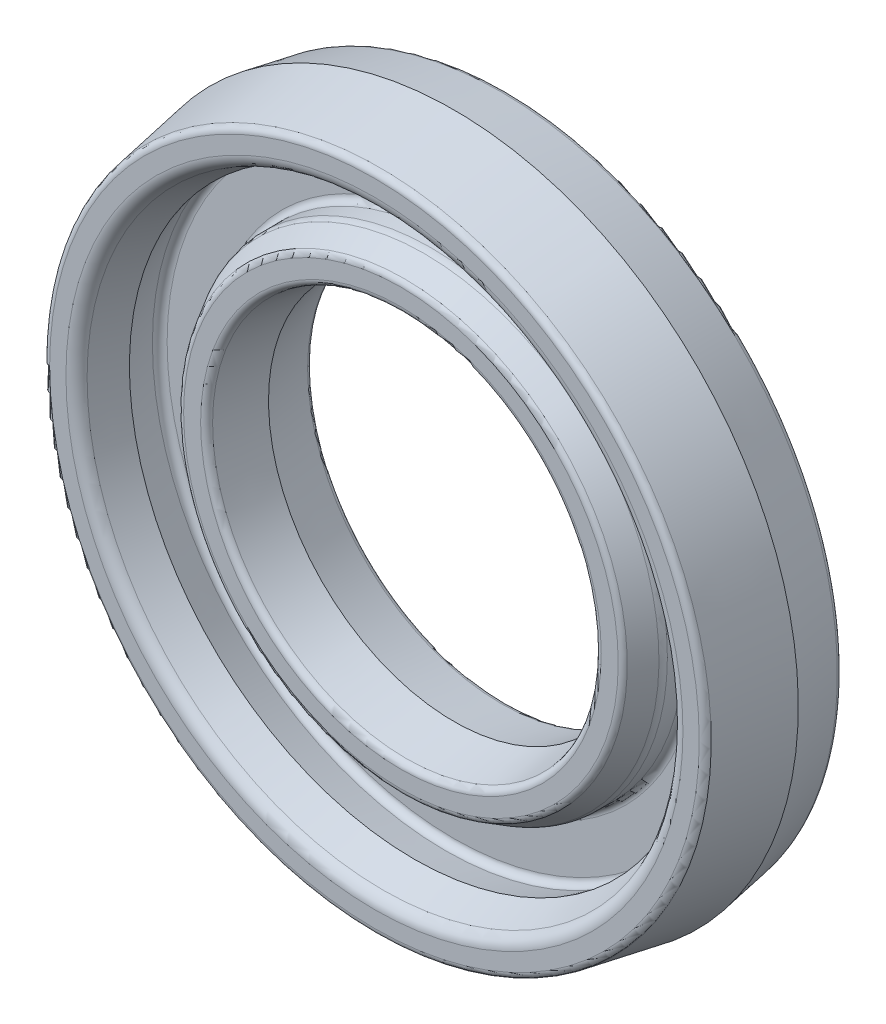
ISO-10303-21;
HEADER;
FILE_DESCRIPTION(('STEP AP214'),'2;1');
FILE_NAME('part.step','',(''),(''),'','','');
FILE_SCHEMA(('AUTOMOTIVE_DESIGN { 1 0 10303 214 1 1 1 1 }'));
ENDSEC;
DATA;
#1=APPLICATION_CONTEXT('core data for automotive mechanical design processes');
#2=APPLICATION_PROTOCOL_DEFINITION('international standard','automotive_design',2000,#1);
#3=PRODUCT_CONTEXT('',#1,'mechanical');
#4=PRODUCT('Part','Part','',(#3));
#5=PRODUCT_RELATED_PRODUCT_CATEGORY('part','',(#4));
#6=PRODUCT_DEFINITION_FORMATION('','',#4);
#7=PRODUCT_DEFINITION_CONTEXT('part definition',#1,'design');
#8=PRODUCT_DEFINITION('design','',#6,#7);
#9=PRODUCT_DEFINITION_SHAPE('','',#8);
#10=(LENGTH_UNIT() NAMED_UNIT(*) SI_UNIT(.MILLI.,.METRE.));
#11=(NAMED_UNIT(*) PLANE_ANGLE_UNIT() SI_UNIT($,.RADIAN.));
#12=(NAMED_UNIT(*) SI_UNIT($,.STERADIAN.) SOLID_ANGLE_UNIT());
#13=UNCERTAINTY_MEASURE_WITH_UNIT(LENGTH_MEASURE(1.E-05),#10,'distance_accuracy_value','');
#14=(GEOMETRIC_REPRESENTATION_CONTEXT(3) GLOBAL_UNCERTAINTY_ASSIGNED_CONTEXT((#13)) GLOBAL_UNIT_ASSIGNED_CONTEXT((#10,
#11,#12)) REPRESENTATION_CONTEXT('',''));
#15=CARTESIAN_POINT('',(0.,0.,0.));
#16=DIRECTION('',(0.,0.,1.));
#17=DIRECTION('',(1.,0.,0.));
#18=AXIS2_PLACEMENT_3D('',#15,#16,#17);
#19=CARTESIAN_POINT('',(23.8174584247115,23.8174584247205,4.));
#20=DIRECTION('',(0.,0.,1.));
#21=DIRECTION('',(0.,-1.,0.));
#22=AXIS2_PLACEMENT_3D('',#19,#20,#21);
#23=PLANE('',#22);
#24=CARTESIAN_POINT('',(0.,0.,4.));
#25=DIRECTION('',(0.,0.,1.));
#26=DIRECTION('',(1.,1.90675067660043E-13,0.));
#27=AXIS2_PLACEMENT_3D('',#24,#25,#26);
#28=CIRCLE('',#27,18.34999995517);
#29=CARTESIAN_POINT('',(-3.49753933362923E-12,18.349999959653,4.));
#30=VERTEX_POINT('',#29);
#31=CARTESIAN_POINT('',(18.349999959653,3.49871193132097E-12,4.));
#32=VERTEX_POINT('',#31);
#33=EDGE_CURVE('E188',#30,#32,#28,.F.);
#34=ORIENTED_EDGE('',*,*,#33,.T.);
#35=CARTESIAN_POINT('',(0.,0.,4.));
#36=DIRECTION('',(0.,0.,1.));
#37=DIRECTION('',(1.907363E-13,-1.,0.));
#38=AXIS2_PLACEMENT_3D('',#35,#36,#37);
#39=CIRCLE('',#38,18.34999995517);
#40=CARTESIAN_POINT('',(3.49888766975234E-12,-18.349999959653,4.));
#41=VERTEX_POINT('',#40);
#42=EDGE_CURVE('E174',#32,#41,#39,.F.);
#43=ORIENTED_EDGE('',*,*,#42,.T.);
#44=CARTESIAN_POINT('',(0.,0.,4.));
#45=DIRECTION('',(0.,0.,1.));
#46=DIRECTION('',(-1.,-1.90552602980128E-13,0.));
#47=AXIS2_PLACEMENT_3D('',#44,#45,#46);
#48=CIRCLE('',#47,18.34999995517);
#49=CARTESIAN_POINT('',(-18.349999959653,-3.49816451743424E-12,4.));
#50=VERTEX_POINT('',#49);
#51=EDGE_CURVE('E180',#41,#50,#48,.F.);
#52=ORIENTED_EDGE('',*,*,#51,.T.);
#53=CARTESIAN_POINT('',(0.,0.,4.));
#54=DIRECTION('',(0.,0.,1.));
#55=DIRECTION('',(-1.90613835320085E-13,1.,0.));
#56=AXIS2_PLACEMENT_3D('',#53,#54,#55);
#57=CIRCLE('',#56,18.34999995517);
#58=EDGE_CURVE('E185',#50,#30,#57,.F.);
#59=ORIENTED_EDGE('',*,*,#58,.T.);
#60=EDGE_LOOP('',(#34,#43,#52,#59));
#61=FACE_BOUND('',#60,.T.);
#62=CARTESIAN_POINT('',(0.,0.,4.));
#63=DIRECTION('',(0.,0.,-1.));
#64=DIRECTION('',(-1.90613835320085E-13,1.,0.));
#65=AXIS2_PLACEMENT_3D('',#62,#63,#64);
#66=CIRCLE('',#65,21.65223493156);
#67=CARTESIAN_POINT('',(21.652234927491,-2.90554025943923E-11,4.));
#68=VERTEX_POINT('',#67);
#69=CARTESIAN_POINT('',(-4.12778607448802E-12,21.652234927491,4.));
#70=VERTEX_POINT('',#69);
#71=EDGE_CURVE('E141',#68,#70,#66,.F.);
#72=ORIENTED_EDGE('',*,*,#71,.T.);
#73=CARTESIAN_POINT('',(0.,0.,4.));
#74=DIRECTION('',(0.,0.,-1.));
#75=DIRECTION('',(-1.,-1.90552602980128E-13,0.));
#76=AXIS2_PLACEMENT_3D('',#73,#74,#75);
#77=CIRCLE('',#76,21.65223493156);
#78=CARTESIAN_POINT('',(-21.652234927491,-4.12714480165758E-12,4.));
#79=VERTEX_POINT('',#78);
#80=EDGE_CURVE('E132',#70,#79,#77,.F.);
#81=ORIENTED_EDGE('',*,*,#80,.T.);
#82=CARTESIAN_POINT('',(0.,0.,4.));
#83=DIRECTION('',(0.,0.,-1.));
#84=DIRECTION('',(1.90491370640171E-13,-1.,0.));
#85=AXIS2_PLACEMENT_3D('',#82,#83,#84);
#86=CIRCLE('',#85,21.65223493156);
#87=CARTESIAN_POINT('',(4.12937705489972E-12,-21.652234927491,4.));
#88=VERTEX_POINT('',#87);
#89=EDGE_CURVE('E125',#79,#88,#86,.F.);
#90=ORIENTED_EDGE('',*,*,#89,.T.);
#91=CARTESIAN_POINT('',(0.,0.,4.));
#92=DIRECTION('',(0.,0.,-1.));
#93=DIRECTION('',(1.,1.90675067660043E-13,0.));
#94=AXIS2_PLACEMENT_3D('',#91,#92,#93);
#95=CIRCLE('',#94,21.65223493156);
#96=EDGE_CURVE('E128',#88,#68,#95,.F.);
#97=ORIENTED_EDGE('',*,*,#96,.T.);
#98=EDGE_LOOP('',(#72,#81,#90,#97));
#99=FACE_BOUND('',#98,.T.);
#100=ADVANCED_FACE('F16',(#61,#99),#23,.T.);
#101=CARTESIAN_POINT('',(0.,0.,4.5));
#102=DIRECTION('',(0.,0.,1.));
#103=DIRECTION('',(1.907363E-13,-1.,0.));
#104=AXIS2_PLACEMENT_3D('',#101,#102,#103);
#105=TOROIDAL_SURFACE('',#104,18.35,0.5);
#106=CARTESIAN_POINT('',(0.,0.,4.5));
#107=DIRECTION('',(0.,0.,-1.));
#108=DIRECTION('',(0.,1.,0.));
#109=AXIS2_PLACEMENT_3D('',#106,#107,#108);
#110=CIRCLE('',#109,17.85);
#111=CARTESIAN_POINT('',(0.,17.85,4.5));
#112=VERTEX_POINT('',#111);
#113=EDGE_CURVE('E172',#112,#112,#110,.F.);
#114=ORIENTED_EDGE('',*,*,#113,.F.);
#115=EDGE_LOOP('',(#114));
#116=FACE_BOUND('',#115,.T.);
#117=ORIENTED_EDGE('',*,*,#42,.F.);
#118=ORIENTED_EDGE('',*,*,#33,.F.);
#119=ORIENTED_EDGE('',*,*,#58,.F.);
#120=ORIENTED_EDGE('',*,*,#51,.F.);
#121=EDGE_LOOP('',(#117,#118,#119,#120));
#122=FACE_BOUND('',#121,.T.);
#123=ADVANCED_FACE('F161',(#116,#122),#105,.F.);
#124=CARTESIAN_POINT('',(0.,0.,4.5));
#125=DIRECTION('',(0.,0.,1.));
#126=DIRECTION('',(1.907363E-13,-1.,0.));
#127=AXIS2_PLACEMENT_3D('',#124,#125,#126);
#128=TOROIDAL_SURFACE('',#127,21.65223489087,0.5);
#129=ORIENTED_EDGE('',*,*,#96,.F.);
#130=ORIENTED_EDGE('',*,*,#89,.F.);
#131=ORIENTED_EDGE('',*,*,#80,.F.);
#132=ORIENTED_EDGE('',*,*,#71,.F.);
#133=EDGE_LOOP('',(#129,#130,#131,#132));
#134=FACE_BOUND('',#133,.T.);
#135=CARTESIAN_POINT('',(0.,0.,4.62940950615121));
#136=DIRECTION('',(0.,0.,-1.));
#137=DIRECTION('',(1.90736299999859E-13,-1.,0.));
#138=AXIS2_PLACEMENT_3D('',#135,#136,#137);
#139=CIRCLE('',#138,22.1351977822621);
#140=CARTESIAN_POINT('',(4.22198572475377E-12,-22.1351977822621,4.62940950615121));
#141=VERTEX_POINT('',#140);
#142=EDGE_CURVE('E170',#141,#141,#139,.F.);
#143=ORIENTED_EDGE('',*,*,#142,.T.);
#144=EDGE_LOOP('',(#143));
#145=FACE_BOUND('',#144,.T.);
#146=ADVANCED_FACE('F139',(#134,#145),#128,.F.);
#147=CARTESIAN_POINT('',(0.,0.,-0.5));
#148=DIRECTION('',(0.,0.,-1.));
#149=DIRECTION('',(0.,1.,0.));
#150=AXIS2_PLACEMENT_3D('',#147,#148,#149);
#151=CYLINDRICAL_SURFACE('',#150,17.85);
#152=ORIENTED_EDGE('',*,*,#113,.T.);
#153=EDGE_LOOP('',(#152));
#154=FACE_BOUND('',#153,.T.);
#155=CARTESIAN_POINT('',(0.,0.,5.732050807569));
#156=DIRECTION('',(0.,0.,1.));
#157=DIRECTION('',(1.907363E-13,-1.,0.));
#158=AXIS2_PLACEMENT_3D('',#155,#156,#157);
#159=CIRCLE('',#158,17.85);
#160=CARTESIAN_POINT('',(3.404642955E-12,-17.85,5.732050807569));
#161=VERTEX_POINT('',#160);
#162=EDGE_CURVE('E179',#161,#161,#159,.T.);
#163=ORIENTED_EDGE('',*,*,#162,.F.);
#164=EDGE_LOOP('',(#163));
#165=FACE_BOUND('',#164,.T.);
#166=ADVANCED_FACE('F160',(#154,#165),#151,.T.);
#167=CARTESIAN_POINT('',(0.,0.,4.62940950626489));
#168=DIRECTION('',(0.,0.,-1.));
#169=DIRECTION('',(0.,1.,0.));
#170=AXIS2_PLACEMENT_3D('',#167,#168,#169);
#171=CONICAL_SURFACE('',#170,22.1351977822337,0.261799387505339);
#172=ORIENTED_EDGE('',*,*,#142,.F.);
#173=EDGE_LOOP('',(#172));
#174=FACE_BOUND('',#173,.T.);
#175=CARTESIAN_POINT('',(0.,0.,7.00000000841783));
#176=DIRECTION('',(0.,0.,1.));
#177=DIRECTION('',(1.90736299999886E-13,-1.,0.));
#178=AXIS2_PLACEMENT_3D('',#175,#176,#177);
#179=CIRCLE('',#178,21.4999999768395);
#180=CARTESIAN_POINT('',(4.10083044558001E-12,-21.4999999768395,7.00000000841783));
#181=VERTEX_POINT('',#180);
#182=EDGE_CURVE('E991',#181,#181,#179,.T.);
#183=ORIENTED_EDGE('',*,*,#182,.T.);
#184=EDGE_LOOP('',(#183));
#185=FACE_BOUND('',#184,.T.);
#186=ADVANCED_FACE('F262',(#174,#185),#171,.F.);
#187=CARTESIAN_POINT('',(0.,0.,5.732050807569));
#188=DIRECTION('',(0.,0.,1.));
#189=DIRECTION('',(1.907363E-13,-1.,0.));
#190=AXIS2_PLACEMENT_3D('',#187,#188,#189);
#191=TOROIDAL_SURFACE('',#190,16.85,1.);
#192=ORIENTED_EDGE('',*,*,#162,.T.);
#193=EDGE_LOOP('',(#192));
#194=FACE_BOUND('',#193,.T.);
#195=CARTESIAN_POINT('',(0.,0.,6.23205078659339));
#196=DIRECTION('',(0.,0.,-1.));
#197=DIRECTION('',(-1.90736299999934E-13,1.,0.));
#198=AXIS2_PLACEMENT_3D('',#195,#196,#197);
#199=CIRCLE('',#198,17.7160253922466);
#200=CARTESIAN_POINT('',(-3.379089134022E-12,17.7160253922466,6.23205078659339));
#201=VERTEX_POINT('',#200);
#202=EDGE_CURVE('E254',#201,#201,#199,.F.);
#203=ORIENTED_EDGE('',*,*,#202,.F.);
#204=EDGE_LOOP('',(#203));
#205=FACE_BOUND('',#204,.T.);
#206=ADVANCED_FACE('F259',(#194,#205),#191,.T.);
#207=CARTESIAN_POINT('',(0.,0.,9.34201997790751));
#208=DIRECTION('',(0.,0.,1.));
#209=DIRECTION('',(0.,-1.,0.));
#210=AXIS2_PLACEMENT_3D('',#207,#208,#209);
#211=CONICAL_SURFACE('',#210,22.3524255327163,0.349065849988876);
#212=ORIENTED_EDGE('',*,*,#182,.F.);
#213=EDGE_LOOP('',(#212));
#214=FACE_BOUND('',#213,.T.);
#215=CARTESIAN_POINT('',(0.,0.,9.34201996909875));
#216=DIRECTION('',(0.,0.,1.));
#217=DIRECTION('',(1.907363E-13,-1.,0.));
#218=AXIS2_PLACEMENT_3D('',#215,#216,#217);
#219=CIRCLE('',#218,22.3524255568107);
#220=CARTESIAN_POINT('',(4.26341894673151E-12,-22.3524255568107,9.34201996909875));
#221=VERTEX_POINT('',#220);
#222=EDGE_CURVE('E251',#221,#221,#219,.F.);
#223=ORIENTED_EDGE('',*,*,#222,.F.);
#224=EDGE_LOOP('',(#223));
#225=FACE_BOUND('',#224,.T.);
#226=ADVANCED_FACE('F261',(#214,#225),#211,.F.);
#227=CARTESIAN_POINT('',(0.,0.,6.23205078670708));
#228=DIRECTION('',(0.,0.,-1.));
#229=DIRECTION('',(0.,1.,0.));
#230=AXIS2_PLACEMENT_3D('',#227,#228,#229);
#231=CONICAL_SURFACE('',#230,17.7160253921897,0.52359877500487);
#232=ORIENTED_EDGE('',*,*,#202,.T.);
#233=EDGE_LOOP('',(#232));
#234=FACE_BOUND('',#233,.T.);
#235=CARTESIAN_POINT('',(0.,0.,7.749999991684));
#236=DIRECTION('',(0.,0.,1.));
#237=DIRECTION('',(1.907363E-13,-1.,0.));
#238=AXIS2_PLACEMENT_3D('',#235,#236,#237);
#239=CIRCLE('',#238,16.8396370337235);
#240=CARTESIAN_POINT('',(3.21193006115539E-12,-16.8396370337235,7.749999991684));
#241=VERTEX_POINT('',#240);
#242=EDGE_CURVE('E242',#241,#241,#239,.T.);
#243=ORIENTED_EDGE('',*,*,#242,.F.);
#244=EDGE_LOOP('',(#243));
#245=FACE_BOUND('',#244,.T.);
#246=ADVANCED_FACE('F221',(#234,#245),#231,.T.);
#247=CARTESIAN_POINT('',(0.,0.,9.));
#248=DIRECTION('',(0.,0.,1.));
#249=DIRECTION('',(1.907363E-13,-1.,0.));
#250=AXIS2_PLACEMENT_3D('',#247,#248,#249);
#251=TOROIDAL_SURFACE('',#250,23.29211824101,1.);
#252=CARTESIAN_POINT('',(0.,0.,9.99999999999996));
#253=DIRECTION('',(0.,0.,1.));
#254=DIRECTION('',(-1.,-1.90552602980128E-13,0.));
#255=AXIS2_PLACEMENT_3D('',#252,#253,#254);
#256=CIRCLE('',#255,23.292117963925);
#257=CARTESIAN_POINT('',(-23.292117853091,-4.43958230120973E-12,9.99999999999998));
#258=VERTEX_POINT('',#257);
#259=CARTESIAN_POINT('',(4.4419482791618E-12,-23.292117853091,9.99999999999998));
#260=VERTEX_POINT('',#259);
#261=EDGE_CURVE('E250',#258,#260,#256,.T.);
#262=ORIENTED_EDGE('',*,*,#261,.T.);
#263=CARTESIAN_POINT('',(0.,0.,9.99999999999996));
#264=DIRECTION('',(0.,0.,1.));
#265=DIRECTION('',(1.907363E-13,-1.,0.));
#266=AXIS2_PLACEMENT_3D('',#263,#264,#265);
#267=CIRCLE('',#266,23.292117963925);
#268=CARTESIAN_POINT('',(23.292117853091,4.4417854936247E-12,9.99999999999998));
#269=VERTEX_POINT('',#268);
#270=EDGE_CURVE('E562',#260,#269,#267,.T.);
#271=ORIENTED_EDGE('',*,*,#270,.T.);
#272=CARTESIAN_POINT('',(0.,0.,9.99999999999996));
#273=DIRECTION('',(0.,0.,1.));
#274=DIRECTION('',(1.,1.90675067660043E-13,0.));
#275=AXIS2_PLACEMENT_3D('',#272,#273,#274);
#276=CIRCLE('',#275,23.292117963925);
#277=CARTESIAN_POINT('',(-4.44023680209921E-12,23.292117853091,9.99999999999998));
#278=VERTEX_POINT('',#277);
#279=EDGE_CURVE('E572',#269,#278,#276,.T.);
#280=ORIENTED_EDGE('',*,*,#279,.T.);
#281=CARTESIAN_POINT('',(0.,0.,9.99999999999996));
#282=DIRECTION('',(0.,0.,1.));
#283=DIRECTION('',(-1.90613835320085E-13,1.,0.));
#284=AXIS2_PLACEMENT_3D('',#281,#282,#283);
#285=CIRCLE('',#284,23.292117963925);
#286=EDGE_CURVE('E237',#278,#258,#285,.T.);
#287=ORIENTED_EDGE('',*,*,#286,.T.);
#288=EDGE_LOOP('',(#262,#271,#280,#287));
#289=FACE_BOUND('',#288,.T.);
#290=ORIENTED_EDGE('',*,*,#222,.T.);
#291=EDGE_LOOP('',(#290));
#292=FACE_BOUND('',#291,.T.);
#293=ADVANCED_FACE('F209',(#289,#292),#251,.T.);
#294=CARTESIAN_POINT('',(0.,0.,7.5));
#295=DIRECTION('',(0.,0.,1.));
#296=DIRECTION('',(1.907363E-13,-1.,0.));
#297=AXIS2_PLACEMENT_3D('',#294,#295,#296);
#298=TOROIDAL_SURFACE('',#297,16.40662432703,0.5);
#299=ORIENTED_EDGE('',*,*,#242,.T.);
#300=EDGE_LOOP('',(#299));
#301=FACE_BOUND('',#300,.T.);
#302=CARTESIAN_POINT('',(0.,0.,8.));
#303=DIRECTION('',(0.,0.,-1.));
#304=DIRECTION('',(1.90491370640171E-13,-1.,0.));
#305=AXIS2_PLACEMENT_3D('',#302,#303,#304);
#306=CIRCLE('',#305,16.4066243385);
#307=CARTESIAN_POINT('',(-16.406624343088,-3.12729123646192E-12,8.));
#308=VERTEX_POINT('',#307);
#309=CARTESIAN_POINT('',(3.12799197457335E-12,-16.406624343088,8.));
#310=VERTEX_POINT('',#309);
#311=EDGE_CURVE('E601',#308,#310,#306,.F.);
#312=ORIENTED_EDGE('',*,*,#311,.F.);
#313=CARTESIAN_POINT('',(0.,0.,8.));
#314=DIRECTION('',(0.,0.,-1.));
#315=DIRECTION('',(-1.,-1.90552602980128E-13,0.));
#316=AXIS2_PLACEMENT_3D('',#313,#314,#315);
#317=CIRCLE('',#316,16.4066243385);
#318=CARTESIAN_POINT('',(-5.19018300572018E-12,16.406624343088,8.));
#319=VERTEX_POINT('',#318);
#320=EDGE_CURVE('E603',#319,#308,#317,.F.);
#321=ORIENTED_EDGE('',*,*,#320,.F.);
#322=CARTESIAN_POINT('',(0.,0.,8.));
#323=DIRECTION('',(0.,0.,-1.));
#324=DIRECTION('',(-8.19444156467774E-13,1.,0.));
#325=AXIS2_PLACEMENT_3D('',#322,#323,#324);
#326=CIRCLE('',#325,16.4066243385);
#327=CARTESIAN_POINT('',(16.406624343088,3.12788901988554E-12,8.));
#328=VERTEX_POINT('',#327);
#329=EDGE_CURVE('E606',#328,#319,#326,.F.);
#330=ORIENTED_EDGE('',*,*,#329,.F.);
#331=CARTESIAN_POINT('',(0.,0.,8.));
#332=DIRECTION('',(0.,0.,-1.));
#333=DIRECTION('',(1.,1.90675067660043E-13,0.));
#334=AXIS2_PLACEMENT_3D('',#331,#332,#333);
#335=CIRCLE('',#334,16.4066243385);
#336=EDGE_CURVE('E435',#310,#328,#335,.F.);
#337=ORIENTED_EDGE('',*,*,#336,.F.);
#338=EDGE_LOOP('',(#312,#321,#330,#337));
#339=FACE_BOUND('',#338,.T.);
#340=ADVANCED_FACE('F220',(#301,#339),#298,.T.);
#341=CARTESIAN_POINT('',(-26.9747371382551,26.9747371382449,10.));
#342=DIRECTION('',(0.,0.,-1.));
#343=DIRECTION('',(0.,1.,0.));
#344=AXIS2_PLACEMENT_3D('',#341,#342,#343);
#345=PLANE('',#344);
#346=ORIENTED_EDGE('',*,*,#279,.F.);
#347=ORIENTED_EDGE('',*,*,#270,.F.);
#348=ORIENTED_EDGE('',*,*,#261,.F.);
#349=ORIENTED_EDGE('',*,*,#286,.F.);
#350=EDGE_LOOP('',(#346,#347,#348,#349));
#351=FACE_BOUND('',#350,.T.);
#352=CARTESIAN_POINT('',(0.,0.,10.));
#353=DIRECTION('',(0.,0.,-1.));
#354=DIRECTION('',(1.,1.90675067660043E-13,0.));
#355=AXIS2_PLACEMENT_3D('',#352,#353,#354);
#356=CIRCLE('',#355,24.5224883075);
#357=CARTESIAN_POINT('',(24.522488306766,4.67555737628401E-12,10.));
#358=VERTEX_POINT('',#357);
#359=CARTESIAN_POINT('',(4.67573522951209E-12,-24.522488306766,10.));
#360=VERTEX_POINT('',#359);
#361=EDGE_CURVE('E530',#358,#360,#356,.T.);
#362=ORIENTED_EDGE('',*,*,#361,.F.);
#363=CARTESIAN_POINT('',(0.,0.,10.));
#364=DIRECTION('',(0.,0.,-1.));
#365=DIRECTION('',(-1.90613835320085E-13,1.,0.));
#366=AXIS2_PLACEMENT_3D('',#363,#364,#365);
#367=CIRCLE('',#366,24.5224883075);
#368=CARTESIAN_POINT('',(-4.67393334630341E-12,24.522488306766,10.));
#369=VERTEX_POINT('',#368);
#370=EDGE_CURVE('E520',#369,#358,#367,.T.);
#371=ORIENTED_EDGE('',*,*,#370,.F.);
#372=CARTESIAN_POINT('',(0.,0.,10.));
#373=DIRECTION('',(0.,0.,-1.));
#374=DIRECTION('',(-1.,-1.90552602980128E-13,0.));
#375=AXIS2_PLACEMENT_3D('',#372,#373,#374);
#376=CIRCLE('',#375,24.5224883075);
#377=CARTESIAN_POINT('',(-24.522488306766,-4.67332404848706E-12,10.));
#378=VERTEX_POINT('',#377);
#379=EDGE_CURVE('E509',#378,#369,#376,.T.);
#380=ORIENTED_EDGE('',*,*,#379,.F.);
#381=CARTESIAN_POINT('',(0.,0.,10.));
#382=DIRECTION('',(0.,0.,-1.));
#383=DIRECTION('',(1.90491370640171E-13,-1.,0.));
#384=AXIS2_PLACEMENT_3D('',#381,#382,#383);
#385=CIRCLE('',#384,24.5224883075);
#386=EDGE_CURVE('E540',#360,#378,#385,.T.);
#387=ORIENTED_EDGE('',*,*,#386,.F.);
#388=EDGE_LOOP('',(#362,#371,#380,#387));
#389=FACE_BOUND('',#388,.T.);
#390=ADVANCED_FACE('F448',(#351,#389),#345,.F.);
#391=CARTESIAN_POINT('',(18.0472867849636,18.0472867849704,8.));
#392=DIRECTION('',(0.,0.,1.));
#393=DIRECTION('',(0.,-1.,0.));
#394=AXIS2_PLACEMENT_3D('',#391,#392,#393);
#395=PLANE('',#394);
#396=CARTESIAN_POINT('',(0.,0.,7.99999999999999));
#397=DIRECTION('',(0.,0.,1.));
#398=DIRECTION('',(-1.90613835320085E-13,1.,0.));
#399=AXIS2_PLACEMENT_3D('',#396,#397,#398);
#400=CIRCLE('',#399,15.12485764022);
#401=CARTESIAN_POINT('',(-2.88304844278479E-12,15.12485765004,8.));
#402=VERTEX_POINT('',#401);
#403=CARTESIAN_POINT('',(-15.12485765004,-2.8821183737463E-12,8.));
#404=VERTEX_POINT('',#403);
#405=EDGE_CURVE('E686',#402,#404,#400,.T.);
#406=ORIENTED_EDGE('',*,*,#405,.F.);
#407=CARTESIAN_POINT('',(0.,0.,7.99999999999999));
#408=DIRECTION('',(0.,0.,1.));
#409=DIRECTION('',(1.,1.90675067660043E-13,0.));
#410=AXIS2_PLACEMENT_3D('',#407,#408,#409);
#411=CIRCLE('',#410,15.12485764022);
#412=CARTESIAN_POINT('',(15.12485765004,2.88476643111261E-12,8.));
#413=VERTEX_POINT('',#412);
#414=EDGE_CURVE('E393',#413,#402,#411,.T.);
#415=ORIENTED_EDGE('',*,*,#414,.F.);
#416=CARTESIAN_POINT('',(0.,0.,7.99999999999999));
#417=DIRECTION('',(0.,0.,1.));
#418=DIRECTION('',(1.907363E-13,-1.,0.));
#419=AXIS2_PLACEMENT_3D('',#416,#417,#418);
#420=CIRCLE('',#419,15.12485764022);
#421=CARTESIAN_POINT('',(2.88415979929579E-12,-15.12485765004,8.));
#422=VERTEX_POINT('',#421);
#423=EDGE_CURVE('E427',#422,#413,#420,.T.);
#424=ORIENTED_EDGE('',*,*,#423,.F.);
#425=CARTESIAN_POINT('',(0.,0.,7.99999999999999));
#426=DIRECTION('',(0.,0.,1.));
#427=DIRECTION('',(-1.,-1.90552602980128E-13,0.));
#428=AXIS2_PLACEMENT_3D('',#425,#426,#427);
#429=CIRCLE('',#428,15.12485764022);
#430=EDGE_CURVE('E696',#404,#422,#429,.T.);
#431=ORIENTED_EDGE('',*,*,#430,.F.);
#432=EDGE_LOOP('',(#406,#415,#424,#431));
#433=FACE_BOUND('',#432,.T.);
#434=ORIENTED_EDGE('',*,*,#320,.T.);
#435=ORIENTED_EDGE('',*,*,#311,.T.);
#436=ORIENTED_EDGE('',*,*,#336,.T.);
#437=ORIENTED_EDGE('',*,*,#329,.T.);
#438=EDGE_LOOP('',(#434,#435,#436,#437));
#439=FACE_BOUND('',#438,.T.);
#440=ADVANCED_FACE('F440',(#433,#439),#395,.T.);
#441=CARTESIAN_POINT('',(0.,0.,9.5));
#442=DIRECTION('',(0.,0.,1.));
#443=DIRECTION('',(1.907363E-13,-1.,0.));
#444=AXIS2_PLACEMENT_3D('',#441,#442,#443);
#445=TOROIDAL_SURFACE('',#444,24.52248830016,0.5);
#446=ORIENTED_EDGE('',*,*,#361,.T.);
#447=ORIENTED_EDGE('',*,*,#386,.T.);
#448=ORIENTED_EDGE('',*,*,#379,.T.);
#449=ORIENTED_EDGE('',*,*,#370,.T.);
#450=EDGE_LOOP('',(#446,#447,#448,#449));
#451=FACE_BOUND('',#450,.T.);
#452=CARTESIAN_POINT('',(0.,0.,9.58682408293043));
#453=DIRECTION('',(0.,0.,-1.));
#454=DIRECTION('',(1.90736300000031E-13,-1.,0.));
#455=AXIS2_PLACEMENT_3D('',#452,#453,#454);
#456=CIRCLE('',#455,25.0148921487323);
#457=CARTESIAN_POINT('',(4.77124797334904E-12,-25.0148921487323,9.58682408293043));
#458=VERTEX_POINT('',#457);
#459=EDGE_CURVE('E425',#458,#458,#456,.T.);
#460=ORIENTED_EDGE('',*,*,#459,.F.);
#461=EDGE_LOOP('',(#460));
#462=FACE_BOUND('',#461,.T.);
#463=ADVANCED_FACE('F412',(#451,#462),#445,.T.);
#464=CARTESIAN_POINT('',(0.,0.,7.5));
#465=DIRECTION('',(0.,0.,1.));
#466=DIRECTION('',(1.907363E-13,-1.,0.));
#467=AXIS2_PLACEMENT_3D('',#464,#465,#466);
#468=TOROIDAL_SURFACE('',#467,15.12485773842,0.5);
#469=ORIENTED_EDGE('',*,*,#414,.T.);
#470=ORIENTED_EDGE('',*,*,#405,.T.);
#471=ORIENTED_EDGE('',*,*,#430,.T.);
#472=ORIENTED_EDGE('',*,*,#423,.T.);
#473=EDGE_LOOP('',(#469,#470,#471,#472));
#474=FACE_BOUND('',#473,.T.);
#475=CARTESIAN_POINT('',(0.,0.,7.58682407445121));
#476=DIRECTION('',(0.,0.,1.));
#477=DIRECTION('',(-2.47052929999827E-12,1.,0.));
#478=AXIS2_PLACEMENT_3D('',#475,#476,#477);
#479=CIRCLE('',#478,14.6324538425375);
#480=CARTESIAN_POINT('',(-3.61499059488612E-11,14.6324538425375,7.58682407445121));
#481=VERTEX_POINT('',#480);
#482=EDGE_CURVE('E423',#481,#481,#479,.F.);
#483=ORIENTED_EDGE('',*,*,#482,.T.);
#484=EDGE_LOOP('',(#483));
#485=FACE_BOUND('',#484,.T.);
#486=ADVANCED_FACE('F400',(#474,#485),#468,.T.);
#487=CARTESIAN_POINT('',(0.,0.,3.99999999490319));
#488=DIRECTION('',(0.,0.,-1.));
#489=DIRECTION('',(0.,1.,0.));
#490=AXIS2_PLACEMENT_3D('',#487,#488,#489);
#491=CONICAL_SURFACE('',#490,25.9999999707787,0.174532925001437);
#492=ORIENTED_EDGE('',*,*,#459,.T.);
#493=EDGE_LOOP('',(#492));
#494=FACE_BOUND('',#493,.T.);
#495=CARTESIAN_POINT('',(0.,0.,4.00000000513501));
#496=DIRECTION('',(0.,0.,1.));
#497=DIRECTION('',(1.90736299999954E-13,-1.,0.));
#498=AXIS2_PLACEMENT_3D('',#495,#496,#497);
#499=CIRCLE('',#498,25.9999999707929);
#500=CARTESIAN_POINT('',(4.95914379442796E-12,-25.9999999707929,4.00000000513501));
#501=VERTEX_POINT('',#500);
#502=EDGE_CURVE('E700',#501,#501,#499,.F.);
#503=ORIENTED_EDGE('',*,*,#502,.F.);
#504=EDGE_LOOP('',(#503));
#505=FACE_BOUND('',#504,.T.);
#506=ADVANCED_FACE('F411',(#494,#505),#491,.T.);
#507=CARTESIAN_POINT('',(0.,0.,7.58682407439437));
#508=DIRECTION('',(0.,0.,1.));
#509=DIRECTION('',(0.,-1.,0.));
#510=AXIS2_PLACEMENT_3D('',#507,#508,#509);
#511=CONICAL_SURFACE('',#510,14.6324538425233,0.174532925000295);
#512=CARTESIAN_POINT('',(0.,0.,3.99999999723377));
#513=DIRECTION('',(0.,0.,-1.));
#514=DIRECTION('',(1.07853169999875E-12,1.,0.));
#515=AXIS2_PLACEMENT_3D('',#512,#513,#514);
#516=CIRCLE('',#515,13.9999999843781);
#517=CARTESIAN_POINT('',(1.50994437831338E-11,13.9999999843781,3.99999999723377));
#518=VERTEX_POINT('',#517);
#519=EDGE_CURVE('E702',#518,#518,#516,.T.);
#520=ORIENTED_EDGE('',*,*,#519,.T.);
#521=EDGE_LOOP('',(#520));
#522=FACE_BOUND('',#521,.T.);
#523=ORIENTED_EDGE('',*,*,#482,.F.);
#524=EDGE_LOOP('',(#523));
#525=FACE_BOUND('',#524,.T.);
#526=ADVANCED_FACE('F933',(#522,#525),#511,.F.);
#527=CARTESIAN_POINT('',(0.,0.,4.00000000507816));
#528=DIRECTION('',(0.,0.,1.));
#529=DIRECTION('',(0.,-1.,0.));
#530=AXIS2_PLACEMENT_3D('',#527,#528,#529);
#531=CONICAL_SURFACE('',#530,25.9999999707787,0.174532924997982);
#532=ORIENTED_EDGE('',*,*,#502,.T.);
#533=EDGE_LOOP('',(#532));
#534=FACE_BOUND('',#533,.T.);
#535=CARTESIAN_POINT('',(0.,0.,0.413175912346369));
#536=DIRECTION('',(0.,0.,1.));
#537=DIRECTION('',(1.907363E-13,-1.,0.));
#538=AXIS2_PLACEMENT_3D('',#535,#536,#537);
#539=CIRCLE('',#538,25.3675461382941);
#540=CARTESIAN_POINT('',(4.83851189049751E-12,-25.3675461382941,0.413175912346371));
#541=VERTEX_POINT('',#540);
#542=EDGE_CURVE('E706',#541,#541,#539,.F.);
#543=ORIENTED_EDGE('',*,*,#542,.F.);
#544=EDGE_LOOP('',(#543));
#545=FACE_BOUND('',#544,.T.);
#546=ADVANCED_FACE('F942',(#534,#545),#531,.T.);
#547=CARTESIAN_POINT('',(0.,0.,0.413175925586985));
#548=DIRECTION('',(0.,0.,-1.));
#549=DIRECTION('',(0.,1.,0.));
#550=AXIS2_PLACEMENT_3D('',#547,#548,#549);
#551=CONICAL_SURFACE('',#550,14.6324538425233,0.174532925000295);
#552=CARTESIAN_POINT('',(0.,0.,0.413175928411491));
#553=DIRECTION('',(0.,0.,1.));
#554=DIRECTION('',(1.907363E-13,-1.,0.));
#555=AXIS2_PLACEMENT_3D('',#552,#553,#554);
#556=CIRCLE('',#555,14.6324538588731);
#557=CARTESIAN_POINT('',(2.79094010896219E-12,-14.6324538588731,0.413175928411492));
#558=VERTEX_POINT('',#557);
#559=EDGE_CURVE('E710',#558,#558,#556,.T.);
#560=ORIENTED_EDGE('',*,*,#559,.F.);
#561=EDGE_LOOP('',(#560));
#562=FACE_BOUND('',#561,.T.);
#563=ORIENTED_EDGE('',*,*,#519,.F.);
#564=EDGE_LOOP('',(#563));
#565=FACE_BOUND('',#564,.T.);
#566=ADVANCED_FACE('F354',(#562,#565),#551,.F.);
#567=CARTESIAN_POINT('',(0.,0.,0.5));
#568=DIRECTION('',(0.,0.,1.));
#569=DIRECTION('',(1.907363E-13,-1.,0.));
#570=AXIS2_PLACEMENT_3D('',#567,#568,#569);
#571=TOROIDAL_SURFACE('',#570,24.87514226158,0.5);
#572=ORIENTED_EDGE('',*,*,#542,.T.);
#573=EDGE_LOOP('',(#572));
#574=FACE_BOUND('',#573,.T.);
#575=CARTESIAN_POINT('',(0.,0.,0.));
#576=DIRECTION('',(0.,0.,1.));
#577=DIRECTION('',(-1.,-1.90552602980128E-13,0.));
#578=AXIS2_PLACEMENT_3D('',#575,#576,#577);
#579=CIRCLE('',#578,24.875142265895);
#580=CARTESIAN_POINT('',(4.74384915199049E-12,-24.875142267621,0.));
#581=VERTEX_POINT('',#580);
#582=CARTESIAN_POINT('',(-24.875142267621,-4.74154747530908E-12,0.));
#583=VERTEX_POINT('',#582);
#584=EDGE_CURVE('E380',#581,#583,#579,.F.);
#585=ORIENTED_EDGE('',*,*,#584,.F.);
#586=CARTESIAN_POINT('',(0.,0.,0.));
#587=DIRECTION('',(0.,0.,1.));
#588=DIRECTION('',(1.907363E-13,-1.,0.));
#589=AXIS2_PLACEMENT_3D('',#586,#587,#588);
#590=CIRCLE('',#589,24.875142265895);
#591=CARTESIAN_POINT('',(24.875142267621,4.74354451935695E-12,0.));
#592=VERTEX_POINT('',#591);
#593=EDGE_CURVE('E712',#592,#581,#590,.F.);
#594=ORIENTED_EDGE('',*,*,#593,.F.);
#595=CARTESIAN_POINT('',(0.,0.,0.));
#596=DIRECTION('',(0.,0.,1.));
#597=DIRECTION('',(1.,1.90675067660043E-13,0.));
#598=AXIS2_PLACEMENT_3D('',#595,#596,#597);
#599=CIRCLE('',#598,24.875142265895);
#600=CARTESIAN_POINT('',(-4.74202135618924E-12,24.875142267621,0.));
#601=VERTEX_POINT('',#600);
#602=EDGE_CURVE('E717',#601,#592,#599,.F.);
#603=ORIENTED_EDGE('',*,*,#602,.F.);
#604=CARTESIAN_POINT('',(0.,0.,0.));
#605=DIRECTION('',(0.,0.,1.));
#606=DIRECTION('',(-1.90613835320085E-13,1.,0.));
#607=AXIS2_PLACEMENT_3D('',#604,#605,#606);
#608=CIRCLE('',#607,24.875142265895);
#609=EDGE_CURVE('E715',#583,#601,#608,.F.);
#610=ORIENTED_EDGE('',*,*,#609,.F.);
#611=EDGE_LOOP('',(#585,#594,#603,#610));
#612=FACE_BOUND('',#611,.T.);
#613=ADVANCED_FACE('F280',(#574,#612),#571,.T.);
#614=CARTESIAN_POINT('',(0.,0.,0.5));
#615=DIRECTION('',(0.,0.,1.));
#616=DIRECTION('',(1.907363E-13,-1.,0.));
#617=AXIS2_PLACEMENT_3D('',#614,#615,#616);
#618=TOROIDAL_SURFACE('',#617,15.12485773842,0.5);
#619=ORIENTED_EDGE('',*,*,#559,.T.);
#620=EDGE_LOOP('',(#619));
#621=FACE_BOUND('',#620,.T.);
#622=CARTESIAN_POINT('',(0.,0.,0.));
#623=DIRECTION('',(0.,0.,-1.));
#624=DIRECTION('',(-1.,-1.90552602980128E-13,0.));
#625=AXIS2_PLACEMENT_3D('',#622,#623,#624);
#626=CIRCLE('',#625,15.124857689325);
#627=CARTESIAN_POINT('',(-2.88304844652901E-12,15.124857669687,0.));
#628=VERTEX_POINT('',#627);
#629=CARTESIAN_POINT('',(-15.124857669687,-2.88360412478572E-12,0.));
#630=VERTEX_POINT('',#629);
#631=EDGE_CURVE('E719',#628,#630,#626,.F.);
#632=ORIENTED_EDGE('',*,*,#631,.F.);
#633=CARTESIAN_POINT('',(0.,0.,0.));
#634=DIRECTION('',(0.,0.,-1.));
#635=DIRECTION('',(-1.90613835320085E-13,1.,0.));
#636=AXIS2_PLACEMENT_3D('',#633,#634,#635);
#637=CIRCLE('',#636,15.124857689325);
#638=CARTESIAN_POINT('',(15.124857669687,2.88466846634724E-12,0.));
#639=VERTEX_POINT('',#638);
#640=EDGE_CURVE('E718',#639,#628,#637,.F.);
#641=ORIENTED_EDGE('',*,*,#640,.F.);
#642=CARTESIAN_POINT('',(0.,0.,0.));
#643=DIRECTION('',(0.,0.,-1.));
#644=DIRECTION('',(1.,1.90675067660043E-13,0.));
#645=AXIS2_PLACEMENT_3D('',#642,#643,#644);
#646=CIRCLE('',#645,15.124857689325);
#647=CARTESIAN_POINT('',(2.88415980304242E-12,-15.124857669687,0.));
#648=VERTEX_POINT('',#647);
#649=EDGE_CURVE('E10',#648,#639,#646,.F.);
#650=ORIENTED_EDGE('',*,*,#649,.F.);
#651=CARTESIAN_POINT('',(0.,0.,0.));
#652=DIRECTION('',(0.,0.,-1.));
#653=DIRECTION('',(1.90491370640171E-13,-1.,0.));
#654=AXIS2_PLACEMENT_3D('',#651,#652,#653);
#655=CIRCLE('',#654,15.124857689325);
#656=EDGE_CURVE('E27',#630,#648,#655,.F.);
#657=ORIENTED_EDGE('',*,*,#656,.F.);
#658=EDGE_LOOP('',(#632,#641,#650,#657));
#659=FACE_BOUND('',#658,.T.);
#660=ADVANCED_FACE('F274',(#621,#659),#618,.T.);
#661=CARTESIAN_POINT('',(-27.3626564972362,27.3626564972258,0.));
#662=DIRECTION('',(0.,0.,-1.));
#663=DIRECTION('',(0.,1.,0.));
#664=AXIS2_PLACEMENT_3D('',#661,#662,#663);
#665=PLANE('',#664);
#666=ORIENTED_EDGE('',*,*,#656,.T.);
#667=ORIENTED_EDGE('',*,*,#649,.T.);
#668=ORIENTED_EDGE('',*,*,#640,.T.);
#669=ORIENTED_EDGE('',*,*,#631,.T.);
#670=EDGE_LOOP('',(#666,#667,#668,#669));
#671=FACE_BOUND('',#670,.T.);
#672=ORIENTED_EDGE('',*,*,#609,.T.);
#673=ORIENTED_EDGE('',*,*,#602,.T.);
#674=ORIENTED_EDGE('',*,*,#593,.T.);
#675=ORIENTED_EDGE('',*,*,#584,.T.);
#676=EDGE_LOOP('',(#672,#673,#674,#675));
#677=FACE_BOUND('',#676,.T.);
#678=ADVANCED_FACE('F272',(#671,#677),#665,.T.);
#679=CLOSED_SHELL('',(#100,#123,#146,#166,#186,#206,#226,#246,#293,#340,#390,#440,#463,#486,
#506,#526,#546,#566,#613,#660,#678));
#680=MANIFOLD_SOLID_BREP('B1',#679);
#681=ADVANCED_BREP_SHAPE_REPRESENTATION('',(#18,#680),#14);
#682=SHAPE_DEFINITION_REPRESENTATION(#9,#681);
ENDSEC;
END-ISO-10303-21;
